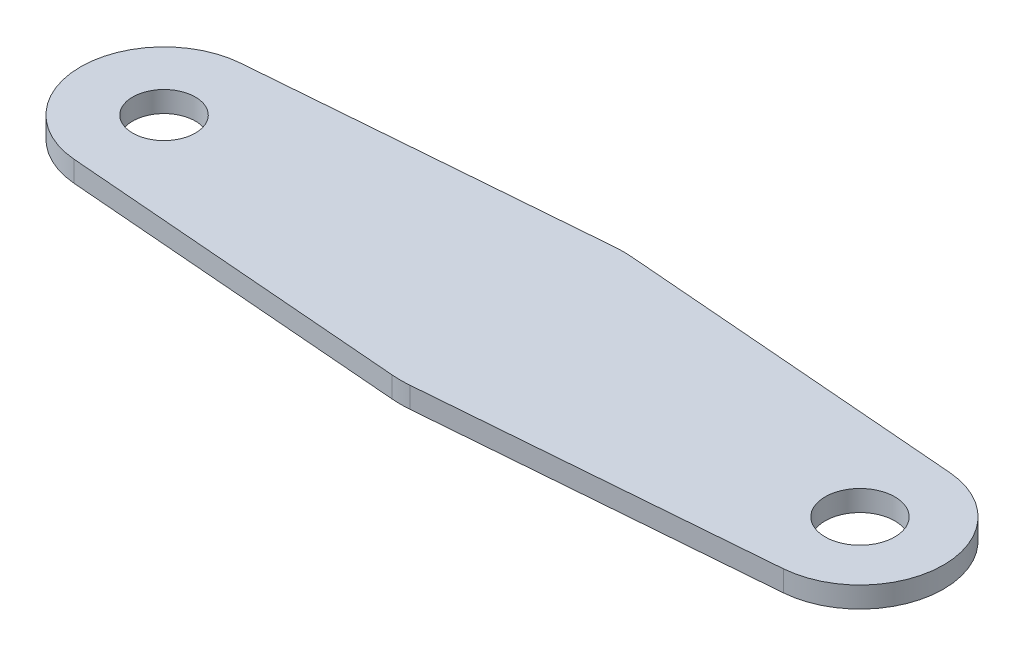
ISO-10303-21;
HEADER;
FILE_DESCRIPTION(('STEP AP214'),'2;1');
FILE_NAME('part.step','',(''),(''),'','','');
FILE_SCHEMA(('AUTOMOTIVE_DESIGN { 1 0 10303 214 1 1 1 1 }'));
ENDSEC;
DATA;
#1=APPLICATION_CONTEXT('core data for automotive mechanical design processes');
#2=APPLICATION_PROTOCOL_DEFINITION('international standard','automotive_design',2000,#1);
#3=PRODUCT_CONTEXT('',#1,'mechanical');
#4=PRODUCT('Part','Part','',(#3));
#5=PRODUCT_RELATED_PRODUCT_CATEGORY('part','',(#4));
#6=PRODUCT_DEFINITION_FORMATION('','',#4);
#7=PRODUCT_DEFINITION_CONTEXT('part definition',#1,'design');
#8=PRODUCT_DEFINITION('design','',#6,#7);
#9=PRODUCT_DEFINITION_SHAPE('','',#8);
#10=(LENGTH_UNIT() NAMED_UNIT(*) SI_UNIT(.MILLI.,.METRE.));
#11=(NAMED_UNIT(*) PLANE_ANGLE_UNIT() SI_UNIT($,.RADIAN.));
#12=(NAMED_UNIT(*) SI_UNIT($,.STERADIAN.) SOLID_ANGLE_UNIT());
#13=UNCERTAINTY_MEASURE_WITH_UNIT(LENGTH_MEASURE(1.E-05),#10,'distance_accuracy_value','');
#14=(GEOMETRIC_REPRESENTATION_CONTEXT(3) GLOBAL_UNCERTAINTY_ASSIGNED_CONTEXT((#13)) GLOBAL_UNIT_ASSIGNED_CONTEXT((#10,
#11,#12)) REPRESENTATION_CONTEXT('',''));
#15=CARTESIAN_POINT('',(0.,0.,0.));
#16=DIRECTION('',(0.,0.,1.));
#17=DIRECTION('',(1.,0.,0.));
#18=AXIS2_PLACEMENT_3D('',#15,#16,#17);
#19=CARTESIAN_POINT('',(-25.,1.5,0.));
#20=DIRECTION('',(0.,1.,0.));
#21=DIRECTION('',(0.,0.,1.));
#22=AXIS2_PLACEMENT_3D('',#19,#20,#21);
#23=PLANE('',#22);
#24=CARTESIAN_POINT('',(25.,1.5,0.));
#25=DIRECTION('',(0.,1.,0.));
#26=DIRECTION('',(0.,0.,1.));
#27=AXIS2_PLACEMENT_3D('',#24,#25,#26);
#28=CIRCLE('',#27,2.5);
#29=CARTESIAN_POINT('',(25.,1.5,2.5));
#30=VERTEX_POINT('',#29);
#31=EDGE_CURVE('E114',#30,#30,#28,.T.);
#32=ORIENTED_EDGE('',*,*,#31,.F.);
#33=EDGE_LOOP('',(#32));
#34=FACE_BOUND('',#33,.T.);
#35=CARTESIAN_POINT('',(-25.,1.5,0.));
#36=DIRECTION('',(0.,1.,0.));
#37=DIRECTION('',(0.,0.,1.));
#38=AXIS2_PLACEMENT_3D('',#35,#36,#37);
#39=CIRCLE('',#38,6.);
#40=CARTESIAN_POINT('',(-25.48,1.5,-5.98076918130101));
#41=VERTEX_POINT('',#40);
#42=CARTESIAN_POINT('',(-25.48,1.5,5.98076918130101));
#43=VERTEX_POINT('',#42);
#44=EDGE_CURVE('E132',#41,#43,#39,.T.);
#45=ORIENTED_EDGE('',*,*,#44,.T.);
#46=DIRECTION('',(0.996794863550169,0.,0.08));
#47=VECTOR('',#46,1.);
#48=CARTESIAN_POINT('',(-25.48,1.5,5.98076918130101));
#49=LINE('',#48,#47);
#50=CARTESIAN_POINT('',(-0.640000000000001,1.5,7.97435890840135));
#51=VERTEX_POINT('',#50);
#52=EDGE_CURVE('E109',#43,#51,#49,.T.);
#53=ORIENTED_EDGE('',*,*,#52,.T.);
#54=CARTESIAN_POINT('',(0.,1.5,0.));
#55=DIRECTION('',(0.,1.,0.));
#56=DIRECTION('',(0.,0.,1.));
#57=AXIS2_PLACEMENT_3D('',#54,#55,#56);
#58=CIRCLE('',#57,8.);
#59=CARTESIAN_POINT('',(0.640000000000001,1.5,7.97435890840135));
#60=VERTEX_POINT('',#59);
#61=EDGE_CURVE('E135',#51,#60,#58,.T.);
#62=ORIENTED_EDGE('',*,*,#61,.T.);
#63=DIRECTION('',(0.996794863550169,0.,-0.0800000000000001));
#64=VECTOR('',#63,1.);
#65=CARTESIAN_POINT('',(0.640000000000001,1.5,7.97435890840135));
#66=LINE('',#65,#64);
#67=CARTESIAN_POINT('',(25.48,1.5,5.98076918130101));
#68=VERTEX_POINT('',#67);
#69=EDGE_CURVE('E137',#60,#68,#66,.T.);
#70=ORIENTED_EDGE('',*,*,#69,.T.);
#71=CARTESIAN_POINT('',(25.,1.5,0.));
#72=DIRECTION('',(0.,1.,0.));
#73=DIRECTION('',(0.,0.,1.));
#74=AXIS2_PLACEMENT_3D('',#71,#72,#73);
#75=CIRCLE('',#74,6.);
#76=CARTESIAN_POINT('',(25.48,1.5,-5.98076918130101));
#77=VERTEX_POINT('',#76);
#78=EDGE_CURVE('E139',#68,#77,#75,.T.);
#79=ORIENTED_EDGE('',*,*,#78,.T.);
#80=DIRECTION('',(-0.996794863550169,0.,-0.0800000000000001));
#81=VECTOR('',#80,1.);
#82=CARTESIAN_POINT('',(0.640000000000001,1.5,-7.97435890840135));
#83=LINE('',#82,#81);
#84=CARTESIAN_POINT('',(0.64,1.5,-7.97435890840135));
#85=VERTEX_POINT('',#84);
#86=EDGE_CURVE('E141',#77,#85,#83,.T.);
#87=ORIENTED_EDGE('',*,*,#86,.T.);
#88=CARTESIAN_POINT('',(0.,1.5,0.));
#89=DIRECTION('',(0.,1.,0.));
#90=DIRECTION('',(0.,0.,1.));
#91=AXIS2_PLACEMENT_3D('',#88,#89,#90);
#92=CIRCLE('',#91,8.);
#93=CARTESIAN_POINT('',(-0.64,1.5,-7.97435890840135));
#94=VERTEX_POINT('',#93);
#95=EDGE_CURVE('E50',#85,#94,#92,.T.);
#96=ORIENTED_EDGE('',*,*,#95,.T.);
#97=DIRECTION('',(-0.996794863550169,0.,0.08));
#98=VECTOR('',#97,1.);
#99=CARTESIAN_POINT('',(-25.48,1.5,-5.98076918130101));
#100=LINE('',#99,#98);
#101=EDGE_CURVE('E45',#94,#41,#100,.T.);
#102=ORIENTED_EDGE('',*,*,#101,.T.);
#103=EDGE_LOOP('',(#45,#53,#62,#70,#79,#87,#96,#102));
#104=FACE_BOUND('',#103,.T.);
#105=CARTESIAN_POINT('',(-25.,1.5,0.));
#106=DIRECTION('',(0.,1.,0.));
#107=DIRECTION('',(0.,0.,1.));
#108=AXIS2_PLACEMENT_3D('',#105,#106,#107);
#109=CIRCLE('',#108,2.25);
#110=CARTESIAN_POINT('',(-25.,1.5,2.25));
#111=VERTEX_POINT('',#110);
#112=EDGE_CURVE('E212',#111,#111,#109,.T.);
#113=ORIENTED_EDGE('',*,*,#112,.F.);
#114=EDGE_LOOP('',(#113));
#115=FACE_BOUND('',#114,.T.);
#116=ADVANCED_FACE('F30',(#34,#104,#115),#23,.T.);
#117=CARTESIAN_POINT('',(-25.,0.,0.));
#118=DIRECTION('',(0.,1.,0.));
#119=DIRECTION('',(0.,0.,1.));
#120=AXIS2_PLACEMENT_3D('',#117,#118,#119);
#121=PLANE('',#120);
#122=CARTESIAN_POINT('',(25.,0.,0.));
#123=DIRECTION('',(0.,1.,0.));
#124=DIRECTION('',(0.,0.,1.));
#125=AXIS2_PLACEMENT_3D('',#122,#123,#124);
#126=CIRCLE('',#125,2.5);
#127=CARTESIAN_POINT('',(25.,0.,2.5));
#128=VERTEX_POINT('',#127);
#129=EDGE_CURVE('E117',#128,#128,#126,.T.);
#130=ORIENTED_EDGE('',*,*,#129,.T.);
#131=EDGE_LOOP('',(#130));
#132=FACE_BOUND('',#131,.T.);
#133=CARTESIAN_POINT('',(-25.,0.,0.));
#134=DIRECTION('',(0.,1.,0.));
#135=DIRECTION('',(0.,0.,1.));
#136=AXIS2_PLACEMENT_3D('',#133,#134,#135);
#137=CIRCLE('',#136,6.);
#138=CARTESIAN_POINT('',(-25.48,0.,-5.98076918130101));
#139=VERTEX_POINT('',#138);
#140=CARTESIAN_POINT('',(-25.48,0.,5.98076918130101));
#141=VERTEX_POINT('',#140);
#142=EDGE_CURVE('E100',#139,#141,#137,.T.);
#143=ORIENTED_EDGE('',*,*,#142,.F.);
#144=DIRECTION('',(-0.996794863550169,0.,0.08));
#145=VECTOR('',#144,1.);
#146=CARTESIAN_POINT('',(-25.48,0.,-5.98076918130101));
#147=LINE('',#146,#145);
#148=CARTESIAN_POINT('',(-0.64,0.,-7.97435890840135));
#149=VERTEX_POINT('',#148);
#150=EDGE_CURVE('E130',#149,#139,#147,.T.);
#151=ORIENTED_EDGE('',*,*,#150,.F.);
#152=CARTESIAN_POINT('',(0.,0.,0.));
#153=DIRECTION('',(0.,1.,0.));
#154=DIRECTION('',(0.,0.,1.));
#155=AXIS2_PLACEMENT_3D('',#152,#153,#154);
#156=CIRCLE('',#155,8.);
#157=CARTESIAN_POINT('',(0.64,0.,-7.97435890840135));
#158=VERTEX_POINT('',#157);
#159=EDGE_CURVE('E128',#158,#149,#156,.T.);
#160=ORIENTED_EDGE('',*,*,#159,.F.);
#161=DIRECTION('',(-0.996794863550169,0.,-0.0800000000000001));
#162=VECTOR('',#161,1.);
#163=CARTESIAN_POINT('',(0.640000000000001,0.,-7.97435890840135));
#164=LINE('',#163,#162);
#165=CARTESIAN_POINT('',(25.48,0.,-5.98076918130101));
#166=VERTEX_POINT('',#165);
#167=EDGE_CURVE('E126',#166,#158,#164,.T.);
#168=ORIENTED_EDGE('',*,*,#167,.F.);
#169=CARTESIAN_POINT('',(25.,0.,0.));
#170=DIRECTION('',(0.,1.,0.));
#171=DIRECTION('',(0.,0.,1.));
#172=AXIS2_PLACEMENT_3D('',#169,#170,#171);
#173=CIRCLE('',#172,6.);
#174=CARTESIAN_POINT('',(25.48,0.,5.98076918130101));
#175=VERTEX_POINT('',#174);
#176=EDGE_CURVE('E124',#175,#166,#173,.T.);
#177=ORIENTED_EDGE('',*,*,#176,.F.);
#178=DIRECTION('',(0.996794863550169,0.,-0.0800000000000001));
#179=VECTOR('',#178,1.);
#180=CARTESIAN_POINT('',(0.640000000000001,0.,7.97435890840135));
#181=LINE('',#180,#179);
#182=CARTESIAN_POINT('',(0.640000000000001,0.,7.97435890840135));
#183=VERTEX_POINT('',#182);
#184=EDGE_CURVE('E122',#183,#175,#181,.T.);
#185=ORIENTED_EDGE('',*,*,#184,.F.);
#186=CARTESIAN_POINT('',(0.,0.,0.));
#187=DIRECTION('',(0.,1.,0.));
#188=DIRECTION('',(0.,0.,1.));
#189=AXIS2_PLACEMENT_3D('',#186,#187,#188);
#190=CIRCLE('',#189,8.);
#191=CARTESIAN_POINT('',(-0.640000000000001,0.,7.97435890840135));
#192=VERTEX_POINT('',#191);
#193=EDGE_CURVE('E102',#192,#183,#190,.T.);
#194=ORIENTED_EDGE('',*,*,#193,.F.);
#195=DIRECTION('',(0.996794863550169,0.,0.08));
#196=VECTOR('',#195,1.);
#197=CARTESIAN_POINT('',(-25.48,0.,5.98076918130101));
#198=LINE('',#197,#196);
#199=EDGE_CURVE('E95',#141,#192,#198,.T.);
#200=ORIENTED_EDGE('',*,*,#199,.F.);
#201=EDGE_LOOP('',(#143,#151,#160,#168,#177,#185,#194,#200));
#202=FACE_BOUND('',#201,.T.);
#203=CARTESIAN_POINT('',(-25.,0.,0.));
#204=DIRECTION('',(0.,1.,0.));
#205=DIRECTION('',(0.,0.,1.));
#206=AXIS2_PLACEMENT_3D('',#203,#204,#205);
#207=CIRCLE('',#206,2.25);
#208=CARTESIAN_POINT('',(-25.,0.,2.25));
#209=VERTEX_POINT('',#208);
#210=EDGE_CURVE('E215',#209,#209,#207,.T.);
#211=ORIENTED_EDGE('',*,*,#210,.T.);
#212=EDGE_LOOP('',(#211));
#213=FACE_BOUND('',#212,.T.);
#214=ADVANCED_FACE('F96',(#132,#202,#213),#121,.F.);
#215=CARTESIAN_POINT('',(-25.,1.5,0.));
#216=DIRECTION('',(0.,-1.,0.));
#217=DIRECTION('',(0.,0.,-1.));
#218=AXIS2_PLACEMENT_3D('',#215,#216,#217);
#219=CYLINDRICAL_SURFACE('',#218,6.);
#220=ORIENTED_EDGE('',*,*,#142,.T.);
#221=DIRECTION('',(0.,-1.,0.));
#222=VECTOR('',#221,1.);
#223=CARTESIAN_POINT('',(-25.48,1.5,5.98076918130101));
#224=LINE('',#223,#222);
#225=EDGE_CURVE('E11',#43,#141,#224,.T.);
#226=ORIENTED_EDGE('',*,*,#225,.F.);
#227=ORIENTED_EDGE('',*,*,#44,.F.);
#228=DIRECTION('',(0.,-1.,0.));
#229=VECTOR('',#228,1.);
#230=CARTESIAN_POINT('',(-25.48,1.5,-5.98076918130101));
#231=LINE('',#230,#229);
#232=EDGE_CURVE('E113',#41,#139,#231,.T.);
#233=ORIENTED_EDGE('',*,*,#232,.T.);
#234=EDGE_LOOP('',(#220,#226,#227,#233));
#235=FACE_BOUND('',#234,.T.);
#236=ADVANCED_FACE('F32',(#235),#219,.T.);
#237=CARTESIAN_POINT('',(-25.48,1.5,5.98076918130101));
#238=DIRECTION('',(0.08,0.,-0.996794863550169));
#239=DIRECTION('',(-0.996794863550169,0.,-0.08));
#240=AXIS2_PLACEMENT_3D('',#237,#238,#239);
#241=PLANE('',#240);
#242=ORIENTED_EDGE('',*,*,#199,.T.);
#243=DIRECTION('',(0.,-1.,0.));
#244=VECTOR('',#243,1.);
#245=CARTESIAN_POINT('',(-0.640000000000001,1.5,7.97435890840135));
#246=LINE('',#245,#244);
#247=EDGE_CURVE('E38',#51,#192,#246,.T.);
#248=ORIENTED_EDGE('',*,*,#247,.F.);
#249=ORIENTED_EDGE('',*,*,#52,.F.);
#250=ORIENTED_EDGE('',*,*,#225,.T.);
#251=EDGE_LOOP('',(#242,#248,#249,#250));
#252=FACE_BOUND('',#251,.T.);
#253=ADVANCED_FACE('F108',(#252),#241,.F.);
#254=CARTESIAN_POINT('',(0.,1.5,0.));
#255=DIRECTION('',(0.,-1.,0.));
#256=DIRECTION('',(0.,0.,-1.));
#257=AXIS2_PLACEMENT_3D('',#254,#255,#256);
#258=CYLINDRICAL_SURFACE('',#257,8.);
#259=ORIENTED_EDGE('',*,*,#193,.T.);
#260=DIRECTION('',(0.,-1.,0.));
#261=VECTOR('',#260,1.);
#262=CARTESIAN_POINT('',(0.640000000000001,1.5,7.97435890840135));
#263=LINE('',#262,#261);
#264=EDGE_CURVE('E158',#60,#183,#263,.T.);
#265=ORIENTED_EDGE('',*,*,#264,.F.);
#266=ORIENTED_EDGE('',*,*,#61,.F.);
#267=ORIENTED_EDGE('',*,*,#247,.T.);
#268=EDGE_LOOP('',(#259,#265,#266,#267));
#269=FACE_BOUND('',#268,.T.);
#270=ADVANCED_FACE('F162',(#269),#258,.T.);
#271=CARTESIAN_POINT('',(0.640000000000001,1.5,7.97435890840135));
#272=DIRECTION('',(-0.0800000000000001,0.,-0.996794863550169));
#273=DIRECTION('',(-0.996794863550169,0.,0.0800000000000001));
#274=AXIS2_PLACEMENT_3D('',#271,#272,#273);
#275=PLANE('',#274);
#276=ORIENTED_EDGE('',*,*,#184,.T.);
#277=DIRECTION('',(0.,-1.,0.));
#278=VECTOR('',#277,1.);
#279=CARTESIAN_POINT('',(25.48,1.5,5.98076918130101));
#280=LINE('',#279,#278);
#281=EDGE_CURVE('E155',#68,#175,#280,.T.);
#282=ORIENTED_EDGE('',*,*,#281,.F.);
#283=ORIENTED_EDGE('',*,*,#69,.F.);
#284=ORIENTED_EDGE('',*,*,#264,.T.);
#285=EDGE_LOOP('',(#276,#282,#283,#284));
#286=FACE_BOUND('',#285,.T.);
#287=ADVANCED_FACE('F170',(#286),#275,.F.);
#288=CARTESIAN_POINT('',(25.,1.5,0.));
#289=DIRECTION('',(0.,-1.,0.));
#290=DIRECTION('',(0.,0.,-1.));
#291=AXIS2_PLACEMENT_3D('',#288,#289,#290);
#292=CYLINDRICAL_SURFACE('',#291,6.);
#293=ORIENTED_EDGE('',*,*,#176,.T.);
#294=DIRECTION('',(0.,-1.,0.));
#295=VECTOR('',#294,1.);
#296=CARTESIAN_POINT('',(25.48,1.5,-5.98076918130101));
#297=LINE('',#296,#295);
#298=EDGE_CURVE('E152',#77,#166,#297,.T.);
#299=ORIENTED_EDGE('',*,*,#298,.F.);
#300=ORIENTED_EDGE('',*,*,#78,.F.);
#301=ORIENTED_EDGE('',*,*,#281,.T.);
#302=EDGE_LOOP('',(#293,#299,#300,#301));
#303=FACE_BOUND('',#302,.T.);
#304=ADVANCED_FACE('F173',(#303),#292,.T.);
#305=CARTESIAN_POINT('',(0.640000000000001,1.5,-7.97435890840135));
#306=DIRECTION('',(-0.0800000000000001,0.,0.996794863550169));
#307=DIRECTION('',(0.996794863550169,0.,0.0800000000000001));
#308=AXIS2_PLACEMENT_3D('',#305,#306,#307);
#309=PLANE('',#308);
#310=ORIENTED_EDGE('',*,*,#167,.T.);
#311=DIRECTION('',(0.,-1.,0.));
#312=VECTOR('',#311,1.);
#313=CARTESIAN_POINT('',(0.64,1.5,-7.97435890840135));
#314=LINE('',#313,#312);
#315=EDGE_CURVE('E149',#85,#158,#314,.T.);
#316=ORIENTED_EDGE('',*,*,#315,.F.);
#317=ORIENTED_EDGE('',*,*,#86,.F.);
#318=ORIENTED_EDGE('',*,*,#298,.T.);
#319=EDGE_LOOP('',(#310,#316,#317,#318));
#320=FACE_BOUND('',#319,.T.);
#321=ADVANCED_FACE('F178',(#320),#309,.F.);
#322=CARTESIAN_POINT('',(0.,1.5,0.));
#323=DIRECTION('',(0.,-1.,0.));
#324=DIRECTION('',(0.,0.,-1.));
#325=AXIS2_PLACEMENT_3D('',#322,#323,#324);
#326=CYLINDRICAL_SURFACE('',#325,8.);
#327=ORIENTED_EDGE('',*,*,#159,.T.);
#328=DIRECTION('',(0.,-1.,0.));
#329=VECTOR('',#328,1.);
#330=CARTESIAN_POINT('',(-0.64,1.5,-7.97435890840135));
#331=LINE('',#330,#329);
#332=EDGE_CURVE('E146',#94,#149,#331,.T.);
#333=ORIENTED_EDGE('',*,*,#332,.F.);
#334=ORIENTED_EDGE('',*,*,#95,.F.);
#335=ORIENTED_EDGE('',*,*,#315,.T.);
#336=EDGE_LOOP('',(#327,#333,#334,#335));
#337=FACE_BOUND('',#336,.T.);
#338=ADVANCED_FACE('F181',(#337),#326,.T.);
#339=CARTESIAN_POINT('',(-25.48,1.5,-5.98076918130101));
#340=DIRECTION('',(0.08,0.,0.996794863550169));
#341=DIRECTION('',(0.996794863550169,0.,-0.08));
#342=AXIS2_PLACEMENT_3D('',#339,#340,#341);
#343=PLANE('',#342);
#344=ORIENTED_EDGE('',*,*,#150,.T.);
#345=ORIENTED_EDGE('',*,*,#232,.F.);
#346=ORIENTED_EDGE('',*,*,#101,.F.);
#347=ORIENTED_EDGE('',*,*,#332,.T.);
#348=EDGE_LOOP('',(#344,#345,#346,#347));
#349=FACE_BOUND('',#348,.T.);
#350=ADVANCED_FACE('F183',(#349),#343,.F.);
#351=CARTESIAN_POINT('',(25.,1.5,0.));
#352=DIRECTION('',(0.,-1.,0.));
#353=DIRECTION('',(0.,0.,-1.));
#354=AXIS2_PLACEMENT_3D('',#351,#352,#353);
#355=CYLINDRICAL_SURFACE('',#354,2.5);
#356=ORIENTED_EDGE('',*,*,#31,.T.);
#357=EDGE_LOOP('',(#356));
#358=FACE_BOUND('',#357,.T.);
#359=ORIENTED_EDGE('',*,*,#129,.F.);
#360=EDGE_LOOP('',(#359));
#361=FACE_BOUND('',#360,.T.);
#362=ADVANCED_FACE('F185',(#358,#361),#355,.F.);
#363=CARTESIAN_POINT('',(-25.,1.5,0.));
#364=DIRECTION('',(0.,-1.,0.));
#365=DIRECTION('',(0.,0.,-1.));
#366=AXIS2_PLACEMENT_3D('',#363,#364,#365);
#367=CYLINDRICAL_SURFACE('',#366,2.25);
#368=ORIENTED_EDGE('',*,*,#112,.T.);
#369=EDGE_LOOP('',(#368));
#370=FACE_BOUND('',#369,.T.);
#371=ORIENTED_EDGE('',*,*,#210,.F.);
#372=EDGE_LOOP('',(#371));
#373=FACE_BOUND('',#372,.T.);
#374=ADVANCED_FACE('F191',(#370,#373),#367,.F.);
#375=CLOSED_SHELL('',(#116,#214,#236,#253,#270,#287,#304,#321,#338,#350,#362,#374));
#376=MANIFOLD_SOLID_BREP('B2',#375);
#377=ADVANCED_BREP_SHAPE_REPRESENTATION('',(#18,#376),#14);
#378=SHAPE_DEFINITION_REPRESENTATION(#9,#377);
ENDSEC;
END-ISO-10303-21;
